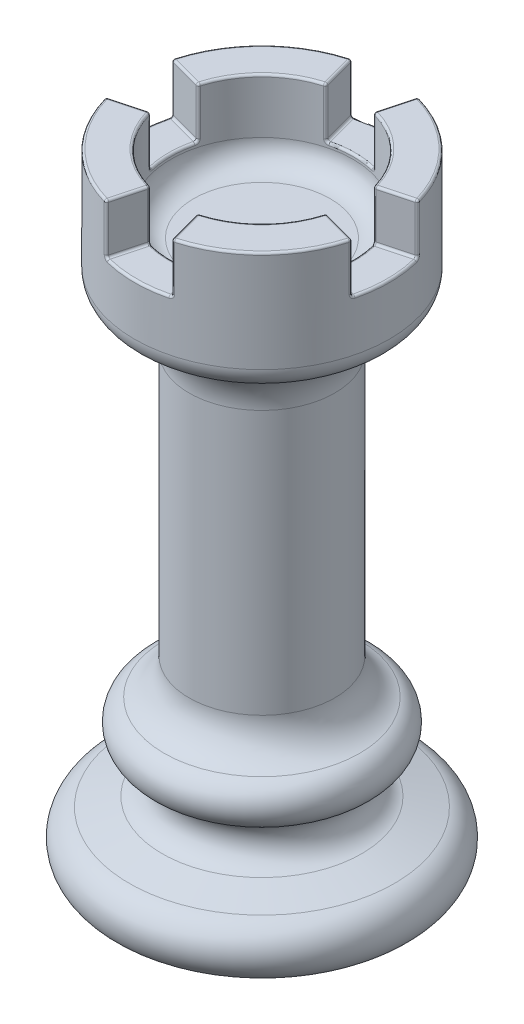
from build123d import *

# Parameters (mm, degrees)
CUT_EXTRUDE1_DEPTH = 5.588
CIRPATTERN1_COUNT  = 4
FILLET3_R          = 0.254


with BuildPart() as part:
    # Sketch1 → Base-Revolve (revolve)
    with BuildSketch(Plane.XY, mode=Mode.PRIVATE) as base_revolve_sk:
        with BuildLine():
            Line((0, 0), (13.97, 0))
            ThreePointArc((13.97, 0), (16.98904598, 2.628875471), (14.800286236, 5.980734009))
            Line((14.800286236, 5.980734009), (11.134368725, 7.018591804))
            ThreePointArc((11.134368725, 7.018591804), (9.288311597, 9.360815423), (10.940995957, 11.843268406))
            ThreePointArc((10.940995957, 11.843268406), (12.595677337, 14.238371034), (10.913999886, 16.614596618))
            ThreePointArc((10.913999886, 16.614596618), (8.894270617, 18.153887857), (8.128, 20.574952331))
            Line((8.128, 20.574952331), (8.128, 50.038952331))
            ThreePointArc((8.128, 50.038952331), (9.320379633, 53.660515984), (12.431058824, 55.865321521))
            ThreePointArc((12.431058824, 55.865321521), (13.727175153, 56.783990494), (14.224, 58.29297535))
            Line((14.224, 58.29297535), (14.224, 69.596))
            Line((14.224, 69.596), (10.16, 69.596))
            Line((10.16, 69.596), (10.16, 63.5))
            ThreePointArc((10.16, 63.5), (9.416051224, 61.703948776), (7.62, 60.96))
            Line((7.62, 60.96), (0, 60.96))
            Line((0, 60.96), (0, 0))
        make_face()
    revolve(base_revolve_sk.sketch.rotate(Axis((0, 0, 0), (0, 1, 0)), 90), axis=Axis((0, 0, 0), (0, 1, 0)))

    # Sketch2 → Cut-Extrude1 (cut)
    with BuildSketch(Plane(origin=(0, 69.596, 0), x_dir=(-1, 0, 0), z_dir=(0, 1, 0))):
        with BuildLine():
            Line((-9.813806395, -2.629601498), (-13.739328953, -3.681442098))
            ThreePointArc((-13.739328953, -3.681442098), (-14.224, 0), (-13.739328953, 3.681442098))
            Line((-13.739328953, 3.681442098), (-9.813806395, 2.629601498))
            ThreePointArc((-9.813806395, 2.629601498), (-10.16, 0), (-9.813806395, -2.629601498))
        make_face()
    cut_extrude1 = extrude(amount=-CUT_EXTRUDE1_DEPTH, mode=Mode.SUBTRACT)

    # CirPattern1: Cut-Extrude1 ×4 about axis
    cirpattern1_axis = Axis((0, 0, 0), (0, 1, 0))
    for i in range(1, CIRPATTERN1_COUNT):
        add(cut_extrude1.rotate(cirpattern1_axis, i * 360 / CIRPATTERN1_COUNT), mode=Mode.SUBTRACT)

    # Fillet3
    fillet3_edges = [part.edges().sort_by_distance(p)[0] for p in [
        (7.184204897, 69.596, 7.184204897),
        (10.057886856, 69.596, 10.057886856),
        (10.16, 64.008, 0),
        (9.813806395, 66.802, 2.629601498),
        (11.776567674, 64.008, -3.155521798),
        (9.813806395, 66.802, -2.629601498),
        (14.224, 64.008, 0),
        (13.739328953, 66.802, -3.681442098),
        (11.776567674, 64.008, 3.155521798),
        (13.739328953, 66.802, 3.681442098),
        (11.776567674, 69.596, 3.155521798),
        (11.776567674, 69.596, -3.155521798),
        (7.184204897, 69.596, -7.184204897),
        (10.057886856, 69.596, -10.057886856),
        (1.326146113, 64.008, -10.073079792),
        (2.629601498, 66.802, -9.813806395),
        (-3.155521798, 64.008, -11.776567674),
        (-2.629601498, 66.802, -9.813806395),
        (1.856604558, 64.008, -14.102311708),
        (-3.681442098, 66.802, -13.739328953),
        (3.155521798, 64.008, -11.776567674),
        (3.681442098, 66.802, -13.739328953),
        (3.155521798, 69.596, -11.776567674),
        (-3.155521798, 69.596, -11.776567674),
        (-7.184204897, 69.596, -7.184204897),
        (-10.057886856, 69.596, -10.057886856),
        (-10.16, 64.008, 0),
        (-9.813806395, 66.802, -2.629601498),
        (-11.776567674, 64.008, 3.155521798),
        (-9.813806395, 66.802, 2.629601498),
        (-14.224, 64.008, 0),
        (-13.739328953, 66.802, 3.681442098),
        (-11.776567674, 64.008, -3.155521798),
        (-13.739328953, 66.802, -3.681442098),
        (-11.776567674, 69.596, -3.155521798),
        (-11.776567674, 69.596, 3.155521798),
        (-7.184204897, 69.596, 7.184204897),
        (-10.057886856, 69.596, 10.057886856),
        (0, 64.008, 10.16),
        (-2.629601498, 66.802, 9.813806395),
        (3.155521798, 64.008, 11.776567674),
        (2.629601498, 66.802, 9.813806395),
        (0, 64.008, 14.224),
        (3.681442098, 66.802, 13.739328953),
        (-3.155521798, 64.008, 11.776567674),
        (-3.681442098, 66.802, 13.739328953),
        (-3.155521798, 69.596, 11.776567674),
        (3.155521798, 69.596, 11.776567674),
    ]]
    fillet(fillet3_edges, radius=FILLET3_R)


solid = part.part
